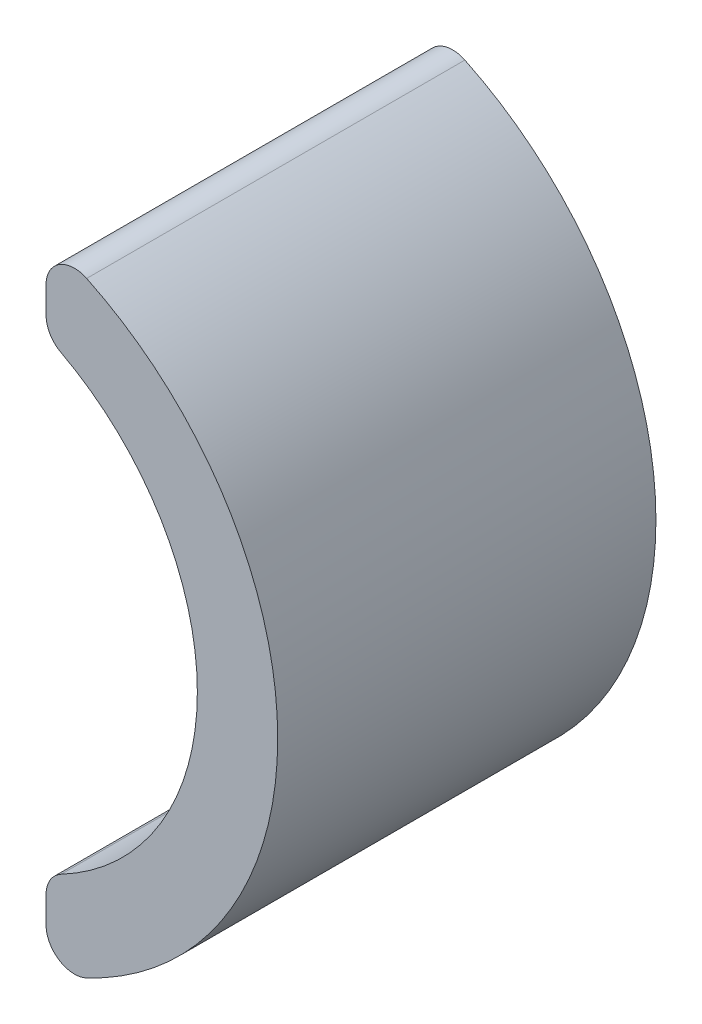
ISO-10303-21;
HEADER;
FILE_DESCRIPTION(('STEP AP214'),'2;1');
FILE_NAME('part.step','',(''),(''),'','','');
FILE_SCHEMA(('AUTOMOTIVE_DESIGN { 1 0 10303 214 1 1 1 1 }'));
ENDSEC;
DATA;
#1=APPLICATION_CONTEXT('core data for automotive mechanical design processes');
#2=APPLICATION_PROTOCOL_DEFINITION('international standard','automotive_design',2000,#1);
#3=PRODUCT_CONTEXT('',#1,'mechanical');
#4=PRODUCT('Part','Part','',(#3));
#5=PRODUCT_RELATED_PRODUCT_CATEGORY('part','',(#4));
#6=PRODUCT_DEFINITION_FORMATION('','',#4);
#7=PRODUCT_DEFINITION_CONTEXT('part definition',#1,'design');
#8=PRODUCT_DEFINITION('design','',#6,#7);
#9=PRODUCT_DEFINITION_SHAPE('','',#8);
#10=(LENGTH_UNIT() NAMED_UNIT(*) SI_UNIT(.MILLI.,.METRE.));
#11=(NAMED_UNIT(*) PLANE_ANGLE_UNIT() SI_UNIT($,.RADIAN.));
#12=(NAMED_UNIT(*) SI_UNIT($,.STERADIAN.) SOLID_ANGLE_UNIT());
#13=UNCERTAINTY_MEASURE_WITH_UNIT(LENGTH_MEASURE(1.E-05),#10,'distance_accuracy_value','');
#14=(GEOMETRIC_REPRESENTATION_CONTEXT(3) GLOBAL_UNCERTAINTY_ASSIGNED_CONTEXT((#13)) GLOBAL_UNIT_ASSIGNED_CONTEXT((#10,
#11,#12)) REPRESENTATION_CONTEXT('',''));
#15=CARTESIAN_POINT('',(0.,0.,0.));
#16=DIRECTION('',(0.,0.,1.));
#17=DIRECTION('',(1.,0.,0.));
#18=AXIS2_PLACEMENT_3D('',#15,#16,#17);
#19=CARTESIAN_POINT('',(14.,-6.76998124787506,58.5));
#20=DIRECTION('',(0.,0.,-1.));
#21=DIRECTION('',(-1.,0.,0.));
#22=AXIS2_PLACEMENT_3D('',#19,#20,#21);
#23=CYLINDRICAL_SURFACE('',#22,3.);
#24=CARTESIAN_POINT('',(14.,-6.76998124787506,18.5));
#25=DIRECTION('',(0.,0.,-1.));
#26=DIRECTION('',(-1.,0.,0.));
#27=AXIS2_PLACEMENT_3D('',#24,#25,#26);
#28=CIRCLE('',#27,3.);
#29=CARTESIAN_POINT('',(11.,-6.76998124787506,18.5));
#30=VERTEX_POINT('',#29);
#31=CARTESIAN_POINT('',(15.2923076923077,-4.06259490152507,18.5));
#32=VERTEX_POINT('',#31);
#33=EDGE_CURVE('E107',#30,#32,#28,.T.);
#34=ORIENTED_EDGE('',*,*,#33,.F.);
#35=DIRECTION('',(0.,0.,-1.));
#36=VECTOR('',#35,1.);
#37=CARTESIAN_POINT('',(11.,-6.76998124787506,58.5));
#38=LINE('',#37,#36);
#39=CARTESIAN_POINT('',(11.,-6.76998124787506,58.5));
#40=VERTEX_POINT('',#39);
#41=EDGE_CURVE('E11',#40,#30,#38,.T.);
#42=ORIENTED_EDGE('',*,*,#41,.F.);
#43=CARTESIAN_POINT('',(14.,-6.76998124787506,58.5));
#44=DIRECTION('',(0.,0.,-1.));
#45=DIRECTION('',(-1.,0.,0.));
#46=AXIS2_PLACEMENT_3D('',#43,#44,#45);
#47=CIRCLE('',#46,3.);
#48=CARTESIAN_POINT('',(15.2923076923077,-4.06259490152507,58.5));
#49=VERTEX_POINT('',#48);
#50=EDGE_CURVE('E114',#40,#49,#47,.T.);
#51=ORIENTED_EDGE('',*,*,#50,.T.);
#52=DIRECTION('',(0.,0.,-1.));
#53=VECTOR('',#52,1.);
#54=CARTESIAN_POINT('',(15.2923076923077,-4.06259490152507,58.5));
#55=LINE('',#54,#53);
#56=EDGE_CURVE('E35',#49,#32,#55,.T.);
#57=ORIENTED_EDGE('',*,*,#56,.T.);
#58=EDGE_LOOP('',(#34,#42,#51,#57));
#59=FACE_BOUND('',#58,.T.);
#60=ADVANCED_FACE('F32',(#59),#23,.T.);
#61=CARTESIAN_POINT('',(11.,-6.76998124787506,58.5));
#62=DIRECTION('',(-1.,0.,0.));
#63=DIRECTION('',(0.,-1.,0.));
#64=AXIS2_PLACEMENT_3D('',#61,#62,#63);
#65=PLANE('',#64);
#66=DIRECTION('',(0.,1.,0.));
#67=VECTOR('',#66,1.);
#68=CARTESIAN_POINT('',(11.,-6.76998124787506,18.5));
#69=LINE('',#68,#67);
#70=CARTESIAN_POINT('',(11.,-9.5670016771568,18.5));
#71=VERTEX_POINT('',#70);
#72=EDGE_CURVE('E112',#71,#30,#69,.T.);
#73=ORIENTED_EDGE('',*,*,#72,.F.);
#74=DIRECTION('',(0.,0.,-1.));
#75=VECTOR('',#74,1.);
#76=CARTESIAN_POINT('',(11.,-9.5670016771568,58.5));
#77=LINE('',#76,#75);
#78=CARTESIAN_POINT('',(11.,-9.5670016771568,58.5));
#79=VERTEX_POINT('',#78);
#80=EDGE_CURVE('E40',#79,#71,#77,.T.);
#81=ORIENTED_EDGE('',*,*,#80,.F.);
#82=DIRECTION('',(0.,1.,0.));
#83=VECTOR('',#82,1.);
#84=CARTESIAN_POINT('',(11.,-6.76998124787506,58.5));
#85=LINE('',#84,#83);
#86=EDGE_CURVE('E115',#79,#40,#85,.T.);
#87=ORIENTED_EDGE('',*,*,#86,.T.);
#88=ORIENTED_EDGE('',*,*,#41,.T.);
#89=EDGE_LOOP('',(#73,#81,#87,#88));
#90=FACE_BOUND('',#89,.T.);
#91=ADVANCED_FACE('F177',(#90),#65,.T.);
#92=CARTESIAN_POINT('',(14.,-9.5670016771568,58.5));
#93=DIRECTION('',(0.,0.,-1.));
#94=DIRECTION('',(-1.,0.,0.));
#95=AXIS2_PLACEMENT_3D('',#92,#93,#94);
#96=CYLINDRICAL_SURFACE('',#95,3.);
#97=CARTESIAN_POINT('',(14.,-9.5670016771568,18.5));
#98=DIRECTION('',(0.,0.,-1.));
#99=DIRECTION('',(-1.,0.,0.));
#100=AXIS2_PLACEMENT_3D('',#97,#98,#99);
#101=CIRCLE('',#100,3.);
#102=CARTESIAN_POINT('',(12.6,-12.2203015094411,18.5));
#103=VERTEX_POINT('',#102);
#104=EDGE_CURVE('E153',#103,#71,#101,.T.);
#105=ORIENTED_EDGE('',*,*,#104,.F.);
#106=DIRECTION('',(0.,0.,-1.));
#107=VECTOR('',#106,1.);
#108=CARTESIAN_POINT('',(12.6,-12.2203015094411,58.5));
#109=LINE('',#108,#107);
#110=CARTESIAN_POINT('',(12.6,-12.2203015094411,58.5));
#111=VERTEX_POINT('',#110);
#112=EDGE_CURVE('E125',#111,#103,#109,.T.);
#113=ORIENTED_EDGE('',*,*,#112,.F.);
#114=CARTESIAN_POINT('',(14.,-9.5670016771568,58.5));
#115=DIRECTION('',(0.,0.,-1.));
#116=DIRECTION('',(-1.,0.,0.));
#117=AXIS2_PLACEMENT_3D('',#114,#115,#116);
#118=CIRCLE('',#117,3.);
#119=EDGE_CURVE('E117',#111,#79,#118,.T.);
#120=ORIENTED_EDGE('',*,*,#119,.T.);
#121=ORIENTED_EDGE('',*,*,#80,.T.);
#122=EDGE_LOOP('',(#105,#113,#120,#121));
#123=FACE_BOUND('',#122,.T.);
#124=ADVANCED_FACE('F179',(#123),#96,.T.);
#125=CARTESIAN_POINT('',(0.,-36.1,58.5));
#126=DIRECTION('',(0.,0.,-1.));
#127=DIRECTION('',(-1.,0.,0.));
#128=AXIS2_PLACEMENT_3D('',#125,#126,#127);
#129=CYLINDRICAL_SURFACE('',#128,27.);
#130=CARTESIAN_POINT('',(0.,-36.1,18.5));
#131=DIRECTION('',(0.,0.,1.));
#132=DIRECTION('',(-1.,0.,0.));
#133=AXIS2_PLACEMENT_3D('',#130,#131,#132);
#134=CIRCLE('',#133,27.);
#135=CARTESIAN_POINT('',(12.6,-59.9796984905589,18.5));
#136=VERTEX_POINT('',#135);
#137=EDGE_CURVE('E150',#136,#103,#134,.T.);
#138=ORIENTED_EDGE('',*,*,#137,.F.);
#139=DIRECTION('',(0.,0.,-1.));
#140=VECTOR('',#139,1.);
#141=CARTESIAN_POINT('',(12.6,-59.9796984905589,58.5));
#142=LINE('',#141,#140);
#143=CARTESIAN_POINT('',(12.6,-59.9796984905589,58.5));
#144=VERTEX_POINT('',#143);
#145=EDGE_CURVE('E127',#144,#136,#142,.T.);
#146=ORIENTED_EDGE('',*,*,#145,.F.);
#147=CARTESIAN_POINT('',(0.,-36.1,58.5));
#148=DIRECTION('',(0.,0.,1.));
#149=DIRECTION('',(-1.,0.,0.));
#150=AXIS2_PLACEMENT_3D('',#147,#148,#149);
#151=CIRCLE('',#150,27.);
#152=EDGE_CURVE('E120',#144,#111,#151,.T.);
#153=ORIENTED_EDGE('',*,*,#152,.T.);
#154=ORIENTED_EDGE('',*,*,#112,.T.);
#155=EDGE_LOOP('',(#138,#146,#153,#154));
#156=FACE_BOUND('',#155,.T.);
#157=ADVANCED_FACE('F168',(#156),#129,.F.);
#158=CARTESIAN_POINT('',(14.,-62.6329983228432,58.5));
#159=DIRECTION('',(0.,0.,-1.));
#160=DIRECTION('',(-1.,0.,0.));
#161=AXIS2_PLACEMENT_3D('',#158,#159,#160);
#162=CYLINDRICAL_SURFACE('',#161,3.);
#163=CARTESIAN_POINT('',(14.,-62.6329983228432,18.5));
#164=DIRECTION('',(0.,0.,-1.));
#165=DIRECTION('',(1.,0.,0.));
#166=AXIS2_PLACEMENT_3D('',#163,#164,#165);
#167=CIRCLE('',#166,3.);
#168=CARTESIAN_POINT('',(11.,-62.6329983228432,18.5));
#169=VERTEX_POINT('',#168);
#170=EDGE_CURVE('E145',#169,#136,#167,.T.);
#171=ORIENTED_EDGE('',*,*,#170,.F.);
#172=DIRECTION('',(0.,0.,-1.));
#173=VECTOR('',#172,1.);
#174=CARTESIAN_POINT('',(11.,-62.6329983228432,58.5));
#175=LINE('',#174,#173);
#176=CARTESIAN_POINT('',(11.,-62.6329983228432,58.5));
#177=VERTEX_POINT('',#176);
#178=EDGE_CURVE('E129',#177,#169,#175,.T.);
#179=ORIENTED_EDGE('',*,*,#178,.F.);
#180=CARTESIAN_POINT('',(14.,-62.6329983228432,58.5));
#181=DIRECTION('',(0.,0.,-1.));
#182=DIRECTION('',(1.,0.,0.));
#183=AXIS2_PLACEMENT_3D('',#180,#181,#182);
#184=CIRCLE('',#183,3.);
#185=EDGE_CURVE('E162',#177,#144,#184,.T.);
#186=ORIENTED_EDGE('',*,*,#185,.T.);
#187=ORIENTED_EDGE('',*,*,#145,.T.);
#188=EDGE_LOOP('',(#171,#179,#186,#187));
#189=FACE_BOUND('',#188,.T.);
#190=ADVANCED_FACE('F175',(#189),#162,.T.);
#191=CARTESIAN_POINT('',(11.,-62.6329983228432,58.5));
#192=DIRECTION('',(-1.,0.,0.));
#193=DIRECTION('',(0.,-1.,0.));
#194=AXIS2_PLACEMENT_3D('',#191,#192,#193);
#195=PLANE('',#194);
#196=DIRECTION('',(0.,1.,0.));
#197=VECTOR('',#196,1.);
#198=CARTESIAN_POINT('',(11.,-62.6329983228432,18.5));
#199=LINE('',#198,#197);
#200=CARTESIAN_POINT('',(11.,-65.4300187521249,18.5));
#201=VERTEX_POINT('',#200);
#202=EDGE_CURVE('E141',#201,#169,#199,.T.);
#203=ORIENTED_EDGE('',*,*,#202,.F.);
#204=DIRECTION('',(0.,0.,-1.));
#205=VECTOR('',#204,1.);
#206=CARTESIAN_POINT('',(11.,-65.4300187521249,58.5));
#207=LINE('',#206,#205);
#208=CARTESIAN_POINT('',(11.,-65.4300187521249,58.5));
#209=VERTEX_POINT('',#208);
#210=EDGE_CURVE('E116',#209,#201,#207,.T.);
#211=ORIENTED_EDGE('',*,*,#210,.F.);
#212=DIRECTION('',(0.,1.,0.));
#213=VECTOR('',#212,1.);
#214=CARTESIAN_POINT('',(11.,-62.6329983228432,58.5));
#215=LINE('',#214,#213);
#216=EDGE_CURVE('E160',#209,#177,#215,.T.);
#217=ORIENTED_EDGE('',*,*,#216,.T.);
#218=ORIENTED_EDGE('',*,*,#178,.T.);
#219=EDGE_LOOP('',(#203,#211,#217,#218));
#220=FACE_BOUND('',#219,.T.);
#221=ADVANCED_FACE('F142',(#220),#195,.T.);
#222=CARTESIAN_POINT('',(14.,-65.4300187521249,58.5));
#223=DIRECTION('',(0.,0.,-1.));
#224=DIRECTION('',(-1.,0.,0.));
#225=AXIS2_PLACEMENT_3D('',#222,#223,#224);
#226=CYLINDRICAL_SURFACE('',#225,3.);
#227=CARTESIAN_POINT('',(14.,-65.4300187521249,18.5));
#228=DIRECTION('',(0.,0.,-1.));
#229=DIRECTION('',(-1.,0.,0.));
#230=AXIS2_PLACEMENT_3D('',#227,#228,#229);
#231=CIRCLE('',#230,3.);
#232=CARTESIAN_POINT('',(15.2923076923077,-68.1374050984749,18.5));
#233=VERTEX_POINT('',#232);
#234=EDGE_CURVE('E106',#233,#201,#231,.T.);
#235=ORIENTED_EDGE('',*,*,#234,.F.);
#236=DIRECTION('',(0.,0.,-1.));
#237=VECTOR('',#236,1.);
#238=CARTESIAN_POINT('',(15.2923076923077,-68.1374050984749,58.5));
#239=LINE('',#238,#237);
#240=CARTESIAN_POINT('',(15.2923076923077,-68.1374050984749,58.5));
#241=VERTEX_POINT('',#240);
#242=EDGE_CURVE('E102',#241,#233,#239,.T.);
#243=ORIENTED_EDGE('',*,*,#242,.F.);
#244=CARTESIAN_POINT('',(14.,-65.4300187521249,58.5));
#245=DIRECTION('',(0.,0.,-1.));
#246=DIRECTION('',(-1.,0.,0.));
#247=AXIS2_PLACEMENT_3D('',#244,#245,#246);
#248=CIRCLE('',#247,3.);
#249=EDGE_CURVE('E136',#241,#209,#248,.T.);
#250=ORIENTED_EDGE('',*,*,#249,.T.);
#251=ORIENTED_EDGE('',*,*,#210,.T.);
#252=EDGE_LOOP('',(#235,#243,#250,#251));
#253=FACE_BOUND('',#252,.T.);
#254=ADVANCED_FACE('F134',(#253),#226,.T.);
#255=CARTESIAN_POINT('',(14.,-6.76998124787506,58.5));
#256=DIRECTION('',(0.,0.,-1.));
#257=DIRECTION('',(-1.,0.,0.));
#258=AXIS2_PLACEMENT_3D('',#255,#256,#257);
#259=PLANE('',#258);
#260=ORIENTED_EDGE('',*,*,#50,.F.);
#261=ORIENTED_EDGE('',*,*,#86,.F.);
#262=ORIENTED_EDGE('',*,*,#119,.F.);
#263=ORIENTED_EDGE('',*,*,#152,.F.);
#264=ORIENTED_EDGE('',*,*,#185,.F.);
#265=ORIENTED_EDGE('',*,*,#216,.F.);
#266=ORIENTED_EDGE('',*,*,#249,.F.);
#267=CARTESIAN_POINT('',(0.,-36.1,58.5));
#268=DIRECTION('',(0.,0.,-1.));
#269=DIRECTION('',(-1.,0.,0.));
#270=AXIS2_PLACEMENT_3D('',#267,#268,#269);
#271=CIRCLE('',#270,35.5);
#272=EDGE_CURVE('E157',#49,#241,#271,.T.);
#273=ORIENTED_EDGE('',*,*,#272,.F.);
#274=EDGE_LOOP('',(#260,#261,#262,#263,#264,#265,#266,#273));
#275=FACE_BOUND('',#274,.T.);
#276=ADVANCED_FACE('F173',(#275),#259,.F.);
#277=CARTESIAN_POINT('',(14.,-6.76998124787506,18.5));
#278=DIRECTION('',(0.,0.,-1.));
#279=DIRECTION('',(-1.,0.,0.));
#280=AXIS2_PLACEMENT_3D('',#277,#278,#279);
#281=PLANE('',#280);
#282=ORIENTED_EDGE('',*,*,#33,.T.);
#283=CARTESIAN_POINT('',(0.,-36.1,18.5));
#284=DIRECTION('',(0.,0.,-1.));
#285=DIRECTION('',(-1.,0.,0.));
#286=AXIS2_PLACEMENT_3D('',#283,#284,#285);
#287=CIRCLE('',#286,35.5);
#288=EDGE_CURVE('E96',#32,#233,#287,.T.);
#289=ORIENTED_EDGE('',*,*,#288,.T.);
#290=ORIENTED_EDGE('',*,*,#234,.T.);
#291=ORIENTED_EDGE('',*,*,#202,.T.);
#292=ORIENTED_EDGE('',*,*,#170,.T.);
#293=ORIENTED_EDGE('',*,*,#137,.T.);
#294=ORIENTED_EDGE('',*,*,#104,.T.);
#295=ORIENTED_EDGE('',*,*,#72,.T.);
#296=EDGE_LOOP('',(#282,#289,#290,#291,#292,#293,#294,#295));
#297=FACE_BOUND('',#296,.T.);
#298=ADVANCED_FACE('F110',(#297),#281,.T.);
#299=CARTESIAN_POINT('',(0.,-36.1,93.5));
#300=DIRECTION('',(0.,0.,-1.));
#301=DIRECTION('',(-1.,0.,0.));
#302=AXIS2_PLACEMENT_3D('',#299,#300,#301);
#303=CYLINDRICAL_SURFACE('',#302,35.5);
#304=ORIENTED_EDGE('',*,*,#272,.T.);
#305=ORIENTED_EDGE('',*,*,#242,.T.);
#306=ORIENTED_EDGE('',*,*,#288,.F.);
#307=ORIENTED_EDGE('',*,*,#56,.F.);
#308=EDGE_LOOP('',(#304,#305,#306,#307));
#309=FACE_BOUND('',#308,.T.);
#310=ADVANCED_FACE('F98',(#309),#303,.T.);
#311=CLOSED_SHELL('',(#60,#91,#124,#157,#190,#221,#254,#276,#298,#310));
#312=MANIFOLD_SOLID_BREP('B2',#311);
#313=ADVANCED_BREP_SHAPE_REPRESENTATION('',(#18,#312),#14);
#314=SHAPE_DEFINITION_REPRESENTATION(#9,#313);
ENDSEC;
END-ISO-10303-21;
